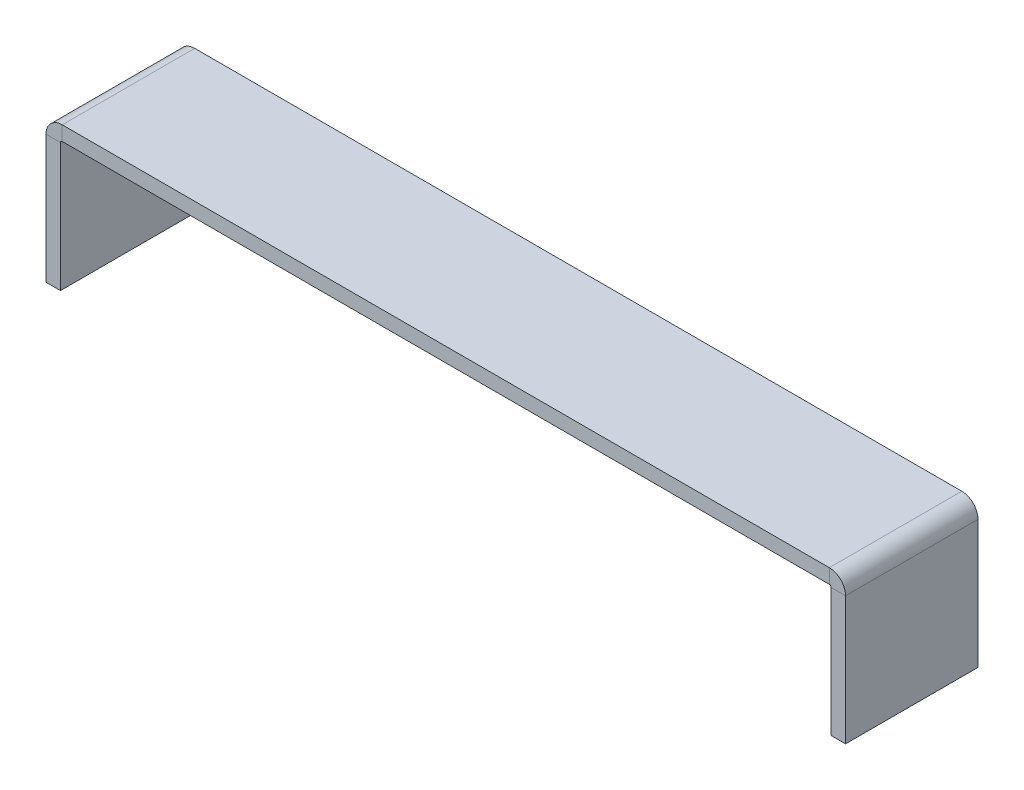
ISO-10303-21;
HEADER;
FILE_DESCRIPTION(('STEP AP214'),'2;1');
FILE_NAME('part.step','',(''),(''),'','','');
FILE_SCHEMA(('AUTOMOTIVE_DESIGN { 1 0 10303 214 1 1 1 1 }'));
ENDSEC;
DATA;
#1=APPLICATION_CONTEXT('core data for automotive mechanical design processes');
#2=APPLICATION_PROTOCOL_DEFINITION('international standard','automotive_design',2000,#1);
#3=PRODUCT_CONTEXT('',#1,'mechanical');
#4=PRODUCT('Part','Part','',(#3));
#5=PRODUCT_RELATED_PRODUCT_CATEGORY('part','',(#4));
#6=PRODUCT_DEFINITION_FORMATION('','',#4);
#7=PRODUCT_DEFINITION_CONTEXT('part definition',#1,'design');
#8=PRODUCT_DEFINITION('design','',#6,#7);
#9=PRODUCT_DEFINITION_SHAPE('','',#8);
#10=(LENGTH_UNIT() NAMED_UNIT(*) SI_UNIT(.MILLI.,.METRE.));
#11=(NAMED_UNIT(*) PLANE_ANGLE_UNIT() SI_UNIT($,.RADIAN.));
#12=(NAMED_UNIT(*) SI_UNIT($,.STERADIAN.) SOLID_ANGLE_UNIT());
#13=UNCERTAINTY_MEASURE_WITH_UNIT(LENGTH_MEASURE(1.E-05),#10,'distance_accuracy_value','');
#14=(GEOMETRIC_REPRESENTATION_CONTEXT(3) GLOBAL_UNCERTAINTY_ASSIGNED_CONTEXT((#13)) GLOBAL_UNIT_ASSIGNED_CONTEXT((#10,
#11,#12)) REPRESENTATION_CONTEXT('',''));
#15=CARTESIAN_POINT('',(0.,0.,0.));
#16=DIRECTION('',(0.,0.,1.));
#17=DIRECTION('',(1.,0.,0.));
#18=AXIS2_PLACEMENT_3D('',#15,#16,#17);
#19=CARTESIAN_POINT('',(159.2634,0.,54.9999999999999));
#20=DIRECTION('',(0.,0.,1.));
#21=DIRECTION('',(1.,0.,0.));
#22=AXIS2_PLACEMENT_3D('',#19,#20,#21);
#23=PLANE('',#22);
#24=DIRECTION('',(0.,1.,0.));
#25=VECTOR('',#24,1.);
#26=CARTESIAN_POINT('',(159.2634,0.,54.9999999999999));
#27=LINE('',#26,#25);
#28=CARTESIAN_POINT('',(159.2634,0.,54.9999999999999));
#29=VERTEX_POINT('',#28);
#30=CARTESIAN_POINT('',(159.2634,6.00000000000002,54.9999999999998));
#31=VERTEX_POINT('',#30);
#32=EDGE_CURVE('E11',#29,#31,#27,.T.);
#33=ORIENTED_EDGE('',*,*,#32,.F.);
#34=CARTESIAN_POINT('',(159.2634,-0.7366,54.9999999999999));
#35=DIRECTION('',(0.,0.,-1.));
#36=DIRECTION('',(-1.,0.,0.));
#37=AXIS2_PLACEMENT_3D('',#34,#35,#36);
#38=CIRCLE('',#37,0.7366);
#39=CARTESIAN_POINT('',(160.,-0.7366,54.9999999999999));
#40=VERTEX_POINT('',#39);
#41=EDGE_CURVE('E197',#40,#29,#38,.F.);
#42=ORIENTED_EDGE('',*,*,#41,.F.);
#43=DIRECTION('',(-1.,0.,0.));
#44=VECTOR('',#43,1.);
#45=CARTESIAN_POINT('',(166.,-0.736599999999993,54.9999999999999));
#46=LINE('',#45,#44);
#47=CARTESIAN_POINT('',(166.,-0.736599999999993,54.9999999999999));
#48=VERTEX_POINT('',#47);
#49=EDGE_CURVE('E50',#48,#40,#46,.T.);
#50=ORIENTED_EDGE('',*,*,#49,.F.);
#51=CARTESIAN_POINT('',(159.2634,-0.7366,54.9999999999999));
#52=DIRECTION('',(0.,0.,1.));
#53=DIRECTION('',(1.,0.,0.));
#54=AXIS2_PLACEMENT_3D('',#51,#52,#53);
#55=CIRCLE('',#54,6.7366);
#56=EDGE_CURVE('E209',#48,#31,#55,.T.);
#57=ORIENTED_EDGE('',*,*,#56,.T.);
#58=EDGE_LOOP('',(#33,#42,#50,#57));
#59=FACE_BOUND('',#58,.T.);
#60=ADVANCED_FACE('F43',(#59),#23,.T.);
#61=CARTESIAN_POINT('',(166.,-0.736599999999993,54.9999999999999));
#62=DIRECTION('',(0.,0.,1.));
#63=DIRECTION('',(1.,0.,0.));
#64=AXIS2_PLACEMENT_3D('',#61,#62,#63);
#65=PLANE('',#64);
#66=DIRECTION('',(-1.,0.,0.));
#67=VECTOR('',#66,1.);
#68=CARTESIAN_POINT('',(-160.,0.,55.0000000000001));
#69=LINE('',#68,#67);
#70=CARTESIAN_POINT('',(-159.2634,0.,55.0000000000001));
#71=VERTEX_POINT('',#70);
#72=EDGE_CURVE('E194',#29,#71,#69,.T.);
#73=ORIENTED_EDGE('',*,*,#72,.F.);
#74=ORIENTED_EDGE('',*,*,#32,.T.);
#75=DIRECTION('',(1.,0.,0.));
#76=VECTOR('',#75,1.);
#77=CARTESIAN_POINT('',(-160.,6.,55.0000000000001));
#78=LINE('',#77,#76);
#79=CARTESIAN_POINT('',(-159.2634,5.99999999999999,55.0000000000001));
#80=VERTEX_POINT('',#79);
#81=EDGE_CURVE('E212',#31,#80,#78,.F.);
#82=ORIENTED_EDGE('',*,*,#81,.T.);
#83=DIRECTION('',(0.,-1.,0.));
#84=VECTOR('',#83,1.);
#85=CARTESIAN_POINT('',(-159.2634,5.99999999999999,55.0000000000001));
#86=LINE('',#85,#84);
#87=EDGE_CURVE('E64',#80,#71,#86,.T.);
#88=ORIENTED_EDGE('',*,*,#87,.T.);
#89=EDGE_LOOP('',(#73,#74,#82,#88));
#90=FACE_BOUND('',#89,.T.);
#91=ADVANCED_FACE('F286',(#90),#65,.T.);
#92=CARTESIAN_POINT('',(160.,-0.736599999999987,-2.22044604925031E-13));
#93=DIRECTION('',(0.,0.,-1.));
#94=DIRECTION('',(-1.,0.,0.));
#95=AXIS2_PLACEMENT_3D('',#92,#93,#94);
#96=PLANE('',#95);
#97=DIRECTION('',(1.,0.,0.));
#98=VECTOR('',#97,1.);
#99=CARTESIAN_POINT('',(160.,-0.736599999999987,-2.22044604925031E-13));
#100=LINE('',#99,#98);
#101=CARTESIAN_POINT('',(160.,-0.736599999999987,-2.22044604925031E-13));
#102=VERTEX_POINT('',#101);
#103=CARTESIAN_POINT('',(166.,-0.736599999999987,-2.22044604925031E-13));
#104=VERTEX_POINT('',#103);
#105=EDGE_CURVE('E250',#102,#104,#100,.T.);
#106=ORIENTED_EDGE('',*,*,#105,.F.);
#107=CARTESIAN_POINT('',(159.2634,-0.736599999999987,-2.22044604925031E-13));
#108=DIRECTION('',(0.,0.,-1.));
#109=DIRECTION('',(-1.,0.,0.));
#110=AXIS2_PLACEMENT_3D('',#107,#108,#109);
#111=CIRCLE('',#110,0.7366);
#112=CARTESIAN_POINT('',(159.2634,0.,-2.22044604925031E-13));
#113=VERTEX_POINT('',#112);
#114=EDGE_CURVE('E164',#102,#113,#111,.F.);
#115=ORIENTED_EDGE('',*,*,#114,.T.);
#116=DIRECTION('',(0.,-1.,0.));
#117=VECTOR('',#116,1.);
#118=CARTESIAN_POINT('',(159.2634,6.00000000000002,-2.22044604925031E-13));
#119=LINE('',#118,#117);
#120=CARTESIAN_POINT('',(159.2634,6.00000000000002,-2.22044604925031E-13));
#121=VERTEX_POINT('',#120);
#122=EDGE_CURVE('E248',#121,#113,#119,.T.);
#123=ORIENTED_EDGE('',*,*,#122,.F.);
#124=CARTESIAN_POINT('',(159.2634,-0.736599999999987,-2.22044604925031E-13));
#125=DIRECTION('',(0.,0.,1.));
#126=DIRECTION('',(1.,0.,0.));
#127=AXIS2_PLACEMENT_3D('',#124,#125,#126);
#128=CIRCLE('',#127,6.7366);
#129=EDGE_CURVE('E176',#104,#121,#128,.T.);
#130=ORIENTED_EDGE('',*,*,#129,.F.);
#131=EDGE_LOOP('',(#106,#115,#123,#130));
#132=FACE_BOUND('',#131,.T.);
#133=ADVANCED_FACE('F294',(#132),#96,.T.);
#134=CARTESIAN_POINT('',(159.2634,6.00000000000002,-2.22044604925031E-13));
#135=DIRECTION('',(0.,0.,-1.));
#136=DIRECTION('',(-1.,0.,0.));
#137=AXIS2_PLACEMENT_3D('',#134,#135,#136);
#138=PLANE('',#137);
#139=DIRECTION('',(0.,1.,0.));
#140=VECTOR('',#139,1.);
#141=CARTESIAN_POINT('',(160.,0.,-2.22044604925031E-13));
#142=LINE('',#141,#140);
#143=CARTESIAN_POINT('',(160.,-54.0000000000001,-2.22044604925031E-13));
#144=VERTEX_POINT('',#143);
#145=EDGE_CURVE('E167',#144,#102,#142,.T.);
#146=ORIENTED_EDGE('',*,*,#145,.T.);
#147=ORIENTED_EDGE('',*,*,#105,.T.);
#148=DIRECTION('',(0.,1.,0.));
#149=VECTOR('',#148,1.);
#150=CARTESIAN_POINT('',(166.,0.,-2.22044604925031E-13));
#151=LINE('',#150,#149);
#152=CARTESIAN_POINT('',(166.,-54.0000000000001,-2.22044604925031E-13));
#153=VERTEX_POINT('',#152);
#154=EDGE_CURVE('E173',#153,#104,#151,.T.);
#155=ORIENTED_EDGE('',*,*,#154,.F.);
#156=DIRECTION('',(-1.,0.,0.));
#157=VECTOR('',#156,1.);
#158=CARTESIAN_POINT('',(166.,-54.0000000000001,-2.22044604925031E-13));
#159=LINE('',#158,#157);
#160=EDGE_CURVE('E170',#153,#144,#159,.T.);
#161=ORIENTED_EDGE('',*,*,#160,.T.);
#162=EDGE_LOOP('',(#146,#147,#155,#161));
#163=FACE_BOUND('',#162,.T.);
#164=ADVANCED_FACE('F296',(#163),#138,.T.);
#165=CARTESIAN_POINT('',(-160.,-0.736600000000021,55.0000000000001));
#166=DIRECTION('',(0.,0.,1.));
#167=DIRECTION('',(1.,0.,0.));
#168=AXIS2_PLACEMENT_3D('',#165,#166,#167);
#169=PLANE('',#168);
#170=DIRECTION('',(-1.,0.,0.));
#171=VECTOR('',#170,1.);
#172=CARTESIAN_POINT('',(-160.,-0.736600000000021,55.0000000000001));
#173=LINE('',#172,#171);
#174=CARTESIAN_POINT('',(-160.,-0.736600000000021,55.0000000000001));
#175=VERTEX_POINT('',#174);
#176=CARTESIAN_POINT('',(-166.,-0.736600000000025,55.0000000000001));
#177=VERTEX_POINT('',#176);
#178=EDGE_CURVE('E57',#175,#177,#173,.T.);
#179=ORIENTED_EDGE('',*,*,#178,.F.);
#180=CARTESIAN_POINT('',(-159.2634,-0.736600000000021,55.0000000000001));
#181=DIRECTION('',(0.,0.,-1.));
#182=DIRECTION('',(-1.,0.,0.));
#183=AXIS2_PLACEMENT_3D('',#180,#181,#182);
#184=CIRCLE('',#183,0.7366);
#185=EDGE_CURVE('E191',#71,#175,#184,.F.);
#186=ORIENTED_EDGE('',*,*,#185,.F.);
#187=ORIENTED_EDGE('',*,*,#87,.F.);
#188=CARTESIAN_POINT('',(-159.2634,-0.736600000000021,55.0000000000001));
#189=DIRECTION('',(0.,0.,1.));
#190=DIRECTION('',(1.,0.,0.));
#191=AXIS2_PLACEMENT_3D('',#188,#189,#190);
#192=CIRCLE('',#191,6.7366);
#193=EDGE_CURVE('E214',#80,#177,#192,.T.);
#194=ORIENTED_EDGE('',*,*,#193,.T.);
#195=EDGE_LOOP('',(#179,#186,#187,#194));
#196=FACE_BOUND('',#195,.T.);
#197=ADVANCED_FACE('F298',(#196),#169,.T.);
#198=CARTESIAN_POINT('',(-159.2634,5.99999999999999,55.0000000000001));
#199=DIRECTION('',(0.,0.,1.));
#200=DIRECTION('',(1.,0.,0.));
#201=AXIS2_PLACEMENT_3D('',#198,#199,#200);
#202=PLANE('',#201);
#203=DIRECTION('',(0.,-1.,0.));
#204=VECTOR('',#203,1.);
#205=CARTESIAN_POINT('',(-160.,0.,55.0000000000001));
#206=LINE('',#205,#204);
#207=CARTESIAN_POINT('',(-160.,-54.0000000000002,54.9999999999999));
#208=VERTEX_POINT('',#207);
#209=EDGE_CURVE('E188',#175,#208,#206,.T.);
#210=ORIENTED_EDGE('',*,*,#209,.F.);
#211=ORIENTED_EDGE('',*,*,#178,.T.);
#212=DIRECTION('',(0.,-1.,0.));
#213=VECTOR('',#212,1.);
#214=CARTESIAN_POINT('',(-166.,0.,55.0000000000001));
#215=LINE('',#214,#213);
#216=CARTESIAN_POINT('',(-166.,-54.0000000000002,54.9999999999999));
#217=VERTEX_POINT('',#216);
#218=EDGE_CURVE('E185',#177,#217,#215,.T.);
#219=ORIENTED_EDGE('',*,*,#218,.T.);
#220=DIRECTION('',(-1.,0.,0.));
#221=VECTOR('',#220,1.);
#222=CARTESIAN_POINT('',(-160.,-54.0000000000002,54.9999999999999));
#223=LINE('',#222,#221);
#224=EDGE_CURVE('E138',#208,#217,#223,.T.);
#225=ORIENTED_EDGE('',*,*,#224,.F.);
#226=EDGE_LOOP('',(#210,#211,#219,#225));
#227=FACE_BOUND('',#226,.T.);
#228=ADVANCED_FACE('F304',(#227),#202,.T.);
#229=CARTESIAN_POINT('',(-159.2634,0.,0.));
#230=DIRECTION('',(0.,0.,-1.));
#231=DIRECTION('',(-1.,0.,0.));
#232=AXIS2_PLACEMENT_3D('',#229,#230,#231);
#233=PLANE('',#232);
#234=DIRECTION('',(0.,1.,0.));
#235=VECTOR('',#234,1.);
#236=CARTESIAN_POINT('',(-159.2634,0.,0.));
#237=LINE('',#236,#235);
#238=CARTESIAN_POINT('',(-159.2634,0.,0.));
#239=VERTEX_POINT('',#238);
#240=CARTESIAN_POINT('',(-159.2634,5.99999999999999,0.));
#241=VERTEX_POINT('',#240);
#242=EDGE_CURVE('E244',#239,#241,#237,.T.);
#243=ORIENTED_EDGE('',*,*,#242,.F.);
#244=CARTESIAN_POINT('',(-159.2634,-0.736600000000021,0.));
#245=DIRECTION('',(0.,0.,-1.));
#246=DIRECTION('',(-1.,0.,0.));
#247=AXIS2_PLACEMENT_3D('',#244,#245,#246);
#248=CIRCLE('',#247,0.7366);
#249=CARTESIAN_POINT('',(-160.,-0.736600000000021,0.));
#250=VERTEX_POINT('',#249);
#251=EDGE_CURVE('E156',#239,#250,#248,.F.);
#252=ORIENTED_EDGE('',*,*,#251,.T.);
#253=DIRECTION('',(1.,0.,0.));
#254=VECTOR('',#253,1.);
#255=CARTESIAN_POINT('',(-166.,-0.736600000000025,0.));
#256=LINE('',#255,#254);
#257=CARTESIAN_POINT('',(-166.,-0.736600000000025,0.));
#258=VERTEX_POINT('',#257);
#259=EDGE_CURVE('E141',#258,#250,#256,.T.);
#260=ORIENTED_EDGE('',*,*,#259,.F.);
#261=CARTESIAN_POINT('',(-159.2634,-0.736600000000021,0.));
#262=DIRECTION('',(0.,0.,1.));
#263=DIRECTION('',(1.,0.,0.));
#264=AXIS2_PLACEMENT_3D('',#261,#262,#263);
#265=CIRCLE('',#264,6.7366);
#266=EDGE_CURVE('E182',#241,#258,#265,.T.);
#267=ORIENTED_EDGE('',*,*,#266,.F.);
#268=EDGE_LOOP('',(#243,#252,#260,#267));
#269=FACE_BOUND('',#268,.T.);
#270=ADVANCED_FACE('F342',(#269),#233,.T.);
#271=CARTESIAN_POINT('',(-166.,-0.736600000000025,0.));
#272=DIRECTION('',(0.,0.,-1.));
#273=DIRECTION('',(-1.,0.,0.));
#274=AXIS2_PLACEMENT_3D('',#271,#272,#273);
#275=PLANE('',#274);
#276=DIRECTION('',(-1.,0.,0.));
#277=VECTOR('',#276,1.);
#278=CARTESIAN_POINT('',(-160.,0.,0.));
#279=LINE('',#278,#277);
#280=EDGE_CURVE('E161',#113,#239,#279,.T.);
#281=ORIENTED_EDGE('',*,*,#280,.T.);
#282=ORIENTED_EDGE('',*,*,#242,.T.);
#283=DIRECTION('',(1.,0.,0.));
#284=VECTOR('',#283,1.);
#285=CARTESIAN_POINT('',(-160.,6.,0.));
#286=LINE('',#285,#284);
#287=EDGE_CURVE('E179',#121,#241,#286,.F.);
#288=ORIENTED_EDGE('',*,*,#287,.F.);
#289=ORIENTED_EDGE('',*,*,#122,.T.);
#290=EDGE_LOOP('',(#281,#282,#288,#289));
#291=FACE_BOUND('',#290,.T.);
#292=ADVANCED_FACE('F351',(#291),#275,.T.);
#293=CARTESIAN_POINT('',(-166.,0.,55.0000000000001));
#294=DIRECTION('',(1.,0.,0.));
#295=DIRECTION('',(0.,1.,0.));
#296=AXIS2_PLACEMENT_3D('',#293,#294,#295);
#297=PLANE('',#296);
#298=DIRECTION('',(0.,-1.,0.));
#299=VECTOR('',#298,1.);
#300=CARTESIAN_POINT('',(-166.,0.,0.));
#301=LINE('',#300,#299);
#302=CARTESIAN_POINT('',(-166.,-54.0000000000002,-2.22044604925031E-13));
#303=VERTEX_POINT('',#302);
#304=EDGE_CURVE('E146',#258,#303,#301,.T.);
#305=ORIENTED_EDGE('',*,*,#304,.T.);
#306=DIRECTION('',(0.,0.,-1.));
#307=VECTOR('',#306,1.);
#308=CARTESIAN_POINT('',(-166.,-54.0000000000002,54.9999999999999));
#309=LINE('',#308,#307);
#310=EDGE_CURVE('E131',#217,#303,#309,.T.);
#311=ORIENTED_EDGE('',*,*,#310,.F.);
#312=ORIENTED_EDGE('',*,*,#218,.F.);
#313=DIRECTION('',(0.,0.,-1.));
#314=VECTOR('',#313,1.);
#315=CARTESIAN_POINT('',(-166.,-0.736600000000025,55.0000000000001));
#316=LINE('',#315,#314);
#317=EDGE_CURVE('E149',#177,#258,#316,.T.);
#318=ORIENTED_EDGE('',*,*,#317,.T.);
#319=EDGE_LOOP('',(#305,#311,#312,#318));
#320=FACE_BOUND('',#319,.T.);
#321=ADVANCED_FACE('F147',(#320),#297,.F.);
#322=CARTESIAN_POINT('',(-160.,-54.0000000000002,54.9999999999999));
#323=DIRECTION('',(0.,-1.,0.));
#324=DIRECTION('',(0.,0.,-1.));
#325=AXIS2_PLACEMENT_3D('',#322,#323,#324);
#326=PLANE('',#325);
#327=DIRECTION('',(-1.,0.,0.));
#328=VECTOR('',#327,1.);
#329=CARTESIAN_POINT('',(-160.,-54.0000000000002,-2.22044604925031E-13));
#330=LINE('',#329,#328);
#331=CARTESIAN_POINT('',(-160.,-54.0000000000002,-2.22044604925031E-13));
#332=VERTEX_POINT('',#331);
#333=EDGE_CURVE('E135',#332,#303,#330,.T.);
#334=ORIENTED_EDGE('',*,*,#333,.F.);
#335=DIRECTION('',(0.,0.,-1.));
#336=VECTOR('',#335,1.);
#337=CARTESIAN_POINT('',(-160.,-54.0000000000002,54.9999999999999));
#338=LINE('',#337,#336);
#339=EDGE_CURVE('E142',#208,#332,#338,.T.);
#340=ORIENTED_EDGE('',*,*,#339,.F.);
#341=ORIENTED_EDGE('',*,*,#224,.T.);
#342=ORIENTED_EDGE('',*,*,#310,.T.);
#343=EDGE_LOOP('',(#334,#340,#341,#342));
#344=FACE_BOUND('',#343,.T.);
#345=ADVANCED_FACE('F133',(#344),#326,.T.);
#346=CARTESIAN_POINT('',(-160.,0.,55.0000000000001));
#347=DIRECTION('',(1.,0.,0.));
#348=DIRECTION('',(0.,1.,0.));
#349=AXIS2_PLACEMENT_3D('',#346,#347,#348);
#350=PLANE('',#349);
#351=DIRECTION('',(0.,-1.,0.));
#352=VECTOR('',#351,1.);
#353=CARTESIAN_POINT('',(-160.,0.,0.));
#354=LINE('',#353,#352);
#355=EDGE_CURVE('E154',#250,#332,#354,.T.);
#356=ORIENTED_EDGE('',*,*,#355,.F.);
#357=DIRECTION('',(0.,0.,-1.));
#358=VECTOR('',#357,1.);
#359=CARTESIAN_POINT('',(-160.,-0.736600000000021,55.0000000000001));
#360=LINE('',#359,#358);
#361=EDGE_CURVE('E239',#175,#250,#360,.T.);
#362=ORIENTED_EDGE('',*,*,#361,.F.);
#363=ORIENTED_EDGE('',*,*,#209,.T.);
#364=ORIENTED_EDGE('',*,*,#339,.T.);
#365=EDGE_LOOP('',(#356,#362,#363,#364));
#366=FACE_BOUND('',#365,.T.);
#367=ADVANCED_FACE('F377',(#366),#350,.T.);
#368=CARTESIAN_POINT('',(-159.2634,-0.736600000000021,55.0000000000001));
#369=DIRECTION('',(0.,0.,-1.));
#370=DIRECTION('',(-1.,0.,0.));
#371=AXIS2_PLACEMENT_3D('',#368,#369,#370);
#372=CYLINDRICAL_SURFACE('',#371,0.7366);
#373=ORIENTED_EDGE('',*,*,#251,.F.);
#374=DIRECTION('',(0.,0.,-1.));
#375=VECTOR('',#374,1.);
#376=CARTESIAN_POINT('',(-159.2634,0.,55.0000000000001));
#377=LINE('',#376,#375);
#378=EDGE_CURVE('E236',#71,#239,#377,.T.);
#379=ORIENTED_EDGE('',*,*,#378,.F.);
#380=ORIENTED_EDGE('',*,*,#185,.T.);
#381=ORIENTED_EDGE('',*,*,#361,.T.);
#382=EDGE_LOOP('',(#373,#379,#380,#381));
#383=FACE_BOUND('',#382,.T.);
#384=ADVANCED_FACE('F386',(#383),#372,.F.);
#385=CARTESIAN_POINT('',(-160.,0.,55.0000000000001));
#386=DIRECTION('',(0.,-1.,0.));
#387=DIRECTION('',(0.,0.,-1.));
#388=AXIS2_PLACEMENT_3D('',#385,#386,#387);
#389=PLANE('',#388);
#390=ORIENTED_EDGE('',*,*,#280,.F.);
#391=DIRECTION('',(0.,0.,-1.));
#392=VECTOR('',#391,1.);
#393=CARTESIAN_POINT('',(159.2634,0.,54.9999999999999));
#394=LINE('',#393,#392);
#395=EDGE_CURVE('E233',#29,#113,#394,.T.);
#396=ORIENTED_EDGE('',*,*,#395,.F.);
#397=ORIENTED_EDGE('',*,*,#72,.T.);
#398=ORIENTED_EDGE('',*,*,#378,.T.);
#399=EDGE_LOOP('',(#390,#396,#397,#398));
#400=FACE_BOUND('',#399,.T.);
#401=ADVANCED_FACE('F290',(#400),#389,.T.);
#402=CARTESIAN_POINT('',(159.2634,-0.7366,54.9999999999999));
#403=DIRECTION('',(0.,0.,-1.));
#404=DIRECTION('',(-1.,0.,0.));
#405=AXIS2_PLACEMENT_3D('',#402,#403,#404);
#406=CYLINDRICAL_SURFACE('',#405,0.7366);
#407=ORIENTED_EDGE('',*,*,#114,.F.);
#408=DIRECTION('',(0.,0.,-1.));
#409=VECTOR('',#408,1.);
#410=CARTESIAN_POINT('',(160.,-0.7366,54.9999999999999));
#411=LINE('',#410,#409);
#412=EDGE_CURVE('E230',#40,#102,#411,.T.);
#413=ORIENTED_EDGE('',*,*,#412,.F.);
#414=ORIENTED_EDGE('',*,*,#41,.T.);
#415=ORIENTED_EDGE('',*,*,#395,.T.);
#416=EDGE_LOOP('',(#407,#413,#414,#415));
#417=FACE_BOUND('',#416,.T.);
#418=ADVANCED_FACE('F262',(#417),#406,.F.);
#419=CARTESIAN_POINT('',(160.,0.,54.9999999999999));
#420=DIRECTION('',(-1.,0.,0.));
#421=DIRECTION('',(0.,0.,1.));
#422=AXIS2_PLACEMENT_3D('',#419,#420,#421);
#423=PLANE('',#422);
#424=ORIENTED_EDGE('',*,*,#145,.F.);
#425=DIRECTION('',(0.,0.,-1.));
#426=VECTOR('',#425,1.);
#427=CARTESIAN_POINT('',(160.,-54.0000000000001,54.9999999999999));
#428=LINE('',#427,#426);
#429=CARTESIAN_POINT('',(160.,-54.0000000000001,54.9999999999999));
#430=VERTEX_POINT('',#429);
#431=EDGE_CURVE('E228',#430,#144,#428,.T.);
#432=ORIENTED_EDGE('',*,*,#431,.F.);
#433=DIRECTION('',(0.,1.,0.));
#434=VECTOR('',#433,1.);
#435=CARTESIAN_POINT('',(160.,0.,54.9999999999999));
#436=LINE('',#435,#434);
#437=EDGE_CURVE('E200',#430,#40,#436,.T.);
#438=ORIENTED_EDGE('',*,*,#437,.T.);
#439=ORIENTED_EDGE('',*,*,#412,.T.);
#440=EDGE_LOOP('',(#424,#432,#438,#439));
#441=FACE_BOUND('',#440,.T.);
#442=ADVANCED_FACE('F266',(#441),#423,.T.);
#443=CARTESIAN_POINT('',(166.,-54.0000000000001,54.9999999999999));
#444=DIRECTION('',(0.,-1.,0.));
#445=DIRECTION('',(0.,0.,-1.));
#446=AXIS2_PLACEMENT_3D('',#443,#444,#445);
#447=PLANE('',#446);
#448=ORIENTED_EDGE('',*,*,#160,.F.);
#449=DIRECTION('',(0.,0.,-1.));
#450=VECTOR('',#449,1.);
#451=CARTESIAN_POINT('',(166.,-54.0000000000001,54.9999999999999));
#452=LINE('',#451,#450);
#453=CARTESIAN_POINT('',(166.,-54.0000000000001,54.9999999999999));
#454=VERTEX_POINT('',#453);
#455=EDGE_CURVE('E226',#454,#153,#452,.T.);
#456=ORIENTED_EDGE('',*,*,#455,.F.);
#457=DIRECTION('',(-1.,0.,0.));
#458=VECTOR('',#457,1.);
#459=CARTESIAN_POINT('',(166.,-54.0000000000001,54.9999999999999));
#460=LINE('',#459,#458);
#461=EDGE_CURVE('E203',#454,#430,#460,.T.);
#462=ORIENTED_EDGE('',*,*,#461,.T.);
#463=ORIENTED_EDGE('',*,*,#431,.T.);
#464=EDGE_LOOP('',(#448,#456,#462,#463));
#465=FACE_BOUND('',#464,.T.);
#466=ADVANCED_FACE('F269',(#465),#447,.T.);
#467=CARTESIAN_POINT('',(166.,0.,54.9999999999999));
#468=DIRECTION('',(-1.,0.,0.));
#469=DIRECTION('',(0.,0.,1.));
#470=AXIS2_PLACEMENT_3D('',#467,#468,#469);
#471=PLANE('',#470);
#472=ORIENTED_EDGE('',*,*,#154,.T.);
#473=DIRECTION('',(0.,0.,-1.));
#474=VECTOR('',#473,1.);
#475=CARTESIAN_POINT('',(166.,-0.736599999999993,54.9999999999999));
#476=LINE('',#475,#474);
#477=EDGE_CURVE('E223',#48,#104,#476,.T.);
#478=ORIENTED_EDGE('',*,*,#477,.F.);
#479=DIRECTION('',(0.,1.,0.));
#480=VECTOR('',#479,1.);
#481=CARTESIAN_POINT('',(166.,0.,54.9999999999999));
#482=LINE('',#481,#480);
#483=EDGE_CURVE('E206',#454,#48,#482,.T.);
#484=ORIENTED_EDGE('',*,*,#483,.F.);
#485=ORIENTED_EDGE('',*,*,#455,.T.);
#486=EDGE_LOOP('',(#472,#478,#484,#485));
#487=FACE_BOUND('',#486,.T.);
#488=ADVANCED_FACE('F272',(#487),#471,.F.);
#489=CARTESIAN_POINT('',(159.2634,-0.7366,54.9999999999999));
#490=DIRECTION('',(0.,0.,-1.));
#491=DIRECTION('',(-1.,0.,0.));
#492=AXIS2_PLACEMENT_3D('',#489,#490,#491);
#493=CYLINDRICAL_SURFACE('',#492,6.7366);
#494=ORIENTED_EDGE('',*,*,#129,.T.);
#495=DIRECTION('',(0.,0.,-1.));
#496=VECTOR('',#495,1.);
#497=CARTESIAN_POINT('',(159.2634,6.00000000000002,54.9999999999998));
#498=LINE('',#497,#496);
#499=EDGE_CURVE('E220',#31,#121,#498,.T.);
#500=ORIENTED_EDGE('',*,*,#499,.F.);
#501=ORIENTED_EDGE('',*,*,#56,.F.);
#502=ORIENTED_EDGE('',*,*,#477,.T.);
#503=EDGE_LOOP('',(#494,#500,#501,#502));
#504=FACE_BOUND('',#503,.T.);
#505=ADVANCED_FACE('F277',(#504),#493,.T.);
#506=CARTESIAN_POINT('',(-160.,6.,55.0000000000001));
#507=DIRECTION('',(0.,-1.,0.));
#508=DIRECTION('',(0.,0.,-1.));
#509=AXIS2_PLACEMENT_3D('',#506,#507,#508);
#510=PLANE('',#509);
#511=ORIENTED_EDGE('',*,*,#287,.T.);
#512=DIRECTION('',(0.,0.,-1.));
#513=VECTOR('',#512,1.);
#514=CARTESIAN_POINT('',(-159.2634,5.99999999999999,55.0000000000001));
#515=LINE('',#514,#513);
#516=EDGE_CURVE('E217',#80,#241,#515,.T.);
#517=ORIENTED_EDGE('',*,*,#516,.F.);
#518=ORIENTED_EDGE('',*,*,#81,.F.);
#519=ORIENTED_EDGE('',*,*,#499,.T.);
#520=EDGE_LOOP('',(#511,#517,#518,#519));
#521=FACE_BOUND('',#520,.T.);
#522=ADVANCED_FACE('F282',(#521),#510,.F.);
#523=CARTESIAN_POINT('',(-159.2634,-0.736600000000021,55.0000000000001));
#524=DIRECTION('',(0.,0.,-1.));
#525=DIRECTION('',(-1.,0.,0.));
#526=AXIS2_PLACEMENT_3D('',#523,#524,#525);
#527=CYLINDRICAL_SURFACE('',#526,6.7366);
#528=ORIENTED_EDGE('',*,*,#266,.T.);
#529=ORIENTED_EDGE('',*,*,#317,.F.);
#530=ORIENTED_EDGE('',*,*,#193,.F.);
#531=ORIENTED_EDGE('',*,*,#516,.T.);
#532=EDGE_LOOP('',(#528,#529,#530,#531));
#533=FACE_BOUND('',#532,.T.);
#534=ADVANCED_FACE('F452',(#533),#527,.T.);
#535=CARTESIAN_POINT('',(-159.2634,-0.736600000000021,55.0000000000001));
#536=DIRECTION('',(0.,0.,-1.));
#537=DIRECTION('',(-1.,0.,0.));
#538=AXIS2_PLACEMENT_3D('',#535,#536,#537);
#539=PLANE('',#538);
#540=ORIENTED_EDGE('',*,*,#483,.T.);
#541=ORIENTED_EDGE('',*,*,#49,.T.);
#542=ORIENTED_EDGE('',*,*,#437,.F.);
#543=ORIENTED_EDGE('',*,*,#461,.F.);
#544=EDGE_LOOP('',(#540,#541,#542,#543));
#545=FACE_BOUND('',#544,.T.);
#546=ADVANCED_FACE('F254',(#545),#539,.F.);
#547=CARTESIAN_POINT('',(-159.2634,-0.736600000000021,0.));
#548=DIRECTION('',(0.,0.,-1.));
#549=DIRECTION('',(-1.,0.,0.));
#550=AXIS2_PLACEMENT_3D('',#547,#548,#549);
#551=PLANE('',#550);
#552=ORIENTED_EDGE('',*,*,#304,.F.);
#553=ORIENTED_EDGE('',*,*,#259,.T.);
#554=ORIENTED_EDGE('',*,*,#355,.T.);
#555=ORIENTED_EDGE('',*,*,#333,.T.);
#556=EDGE_LOOP('',(#552,#553,#554,#555));
#557=FACE_BOUND('',#556,.T.);
#558=ADVANCED_FACE('F152',(#557),#551,.T.);
#559=CLOSED_SHELL('',(#60,#91,#133,#164,#197,#228,#270,#292,#321,#345,#367,#384,#401,#418,#442,
#466,#488,#505,#522,#534,#546,#558));
#560=MANIFOLD_SOLID_BREP('B2',#559);
#561=ADVANCED_BREP_SHAPE_REPRESENTATION('',(#18,#560),#14);
#562=SHAPE_DEFINITION_REPRESENTATION(#9,#561);
ENDSEC;
END-ISO-10303-21;
